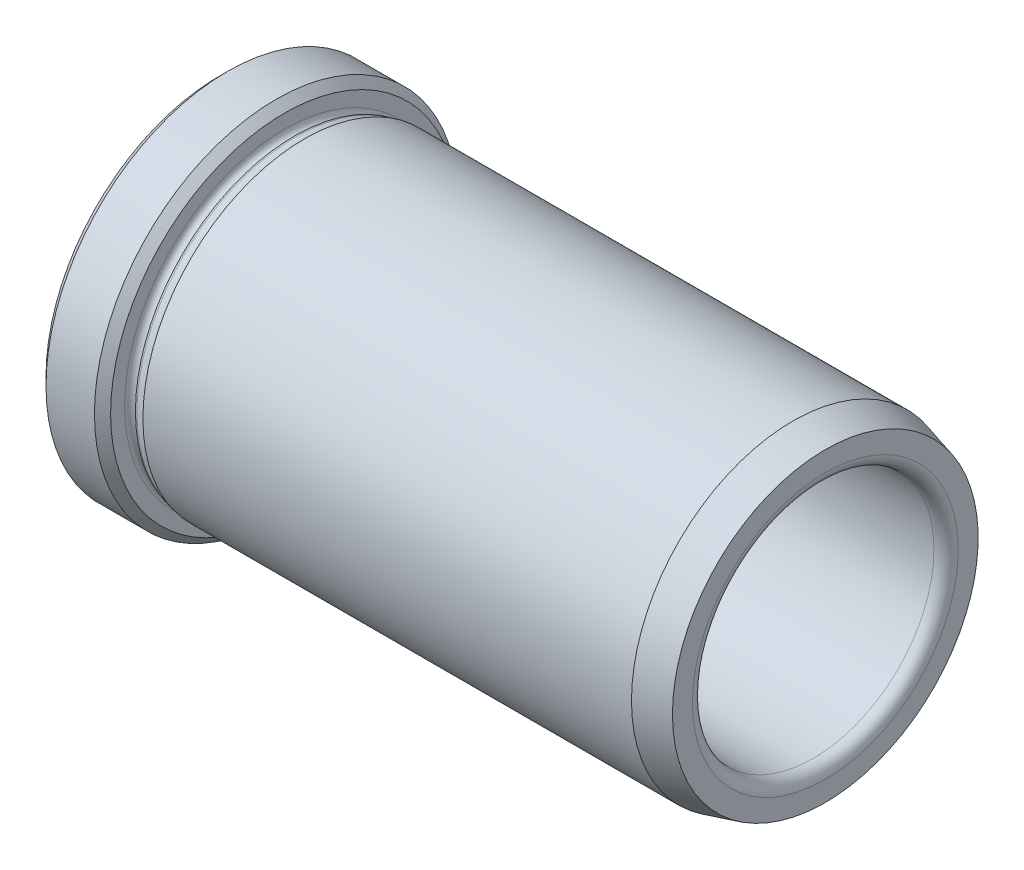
ISO-10303-21;
HEADER;
FILE_DESCRIPTION(('STEP AP214'),'2;1');
FILE_NAME('part.step','',(''),(''),'','','');
FILE_SCHEMA(('AUTOMOTIVE_DESIGN { 1 0 10303 214 1 1 1 1 }'));
ENDSEC;
DATA;
#1=APPLICATION_CONTEXT('core data for automotive mechanical design processes');
#2=APPLICATION_PROTOCOL_DEFINITION('international standard','automotive_design',2000,#1);
#3=PRODUCT_CONTEXT('',#1,'mechanical');
#4=PRODUCT('Part','Part','',(#3));
#5=PRODUCT_RELATED_PRODUCT_CATEGORY('part','',(#4));
#6=PRODUCT_DEFINITION_FORMATION('','',#4);
#7=PRODUCT_DEFINITION_CONTEXT('part definition',#1,'design');
#8=PRODUCT_DEFINITION('design','',#6,#7);
#9=PRODUCT_DEFINITION_SHAPE('','',#8);
#10=(LENGTH_UNIT() NAMED_UNIT(*) SI_UNIT(.MILLI.,.METRE.));
#11=(NAMED_UNIT(*) PLANE_ANGLE_UNIT() SI_UNIT($,.RADIAN.));
#12=(NAMED_UNIT(*) SI_UNIT($,.STERADIAN.) SOLID_ANGLE_UNIT());
#13=UNCERTAINTY_MEASURE_WITH_UNIT(LENGTH_MEASURE(1.E-05),#10,'distance_accuracy_value','');
#14=(GEOMETRIC_REPRESENTATION_CONTEXT(3) GLOBAL_UNCERTAINTY_ASSIGNED_CONTEXT((#13)) GLOBAL_UNIT_ASSIGNED_CONTEXT((#10,
#11,#12)) REPRESENTATION_CONTEXT('',''));
#15=CARTESIAN_POINT('',(0.,0.,0.));
#16=DIRECTION('',(0.,0.,1.));
#17=DIRECTION('',(1.,0.,0.));
#18=AXIS2_PLACEMENT_3D('',#15,#16,#17);
#19=CARTESIAN_POINT('',(30.9097582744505,14.95,0.));
#20=DIRECTION('',(1.,0.,0.));
#21=DIRECTION('',(0.,0.,-1.));
#22=AXIS2_PLACEMENT_3D('',#19,#20,#21);
#23=PLANE('',#22);
#24=CARTESIAN_POINT('',(30.9097582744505,0.,0.));
#25=DIRECTION('',(-1.,0.,0.));
#26=DIRECTION('',(0.,0.,1.));
#27=AXIS2_PLACEMENT_3D('',#24,#25,#26);
#28=CIRCLE('',#27,14.95);
#29=CARTESIAN_POINT('',(30.9097582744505,0.,14.95));
#30=VERTEX_POINT('',#29);
#31=EDGE_CURVE('E46',#30,#30,#28,.T.);
#32=ORIENTED_EDGE('',*,*,#31,.F.);
#33=EDGE_LOOP('',(#32));
#34=FACE_BOUND('',#33,.T.);
#35=CARTESIAN_POINT('',(30.9097582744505,0.,0.));
#36=DIRECTION('',(-1.,0.,0.));
#37=DIRECTION('',(0.,0.,1.));
#38=AXIS2_PLACEMENT_3D('',#35,#36,#37);
#39=CIRCLE('',#38,15.);
#40=CARTESIAN_POINT('',(30.9097582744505,0.,15.));
#41=VERTEX_POINT('',#40);
#42=EDGE_CURVE('E70',#41,#41,#39,.T.);
#43=ORIENTED_EDGE('',*,*,#42,.T.);
#44=EDGE_LOOP('',(#43));
#45=FACE_BOUND('',#44,.T.);
#46=ADVANCED_FACE('F14',(#34,#45),#23,.F.);
#47=CARTESIAN_POINT('',(0.,0.,0.));
#48=DIRECTION('',(-1.,0.,0.));
#49=DIRECTION('',(0.,0.,1.));
#50=AXIS2_PLACEMENT_3D('',#47,#48,#49);
#51=CYLINDRICAL_SURFACE('',#50,14.95);
#52=CARTESIAN_POINT('',(94.4097582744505,0.,0.));
#53=DIRECTION('',(-1.,0.,0.));
#54=DIRECTION('',(0.,0.,1.));
#55=AXIS2_PLACEMENT_3D('',#52,#53,#54);
#56=CIRCLE('',#55,14.95);
#57=CARTESIAN_POINT('',(94.4097582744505,0.,14.95));
#58=VERTEX_POINT('',#57);
#59=EDGE_CURVE('E34',#58,#58,#56,.F.);
#60=ORIENTED_EDGE('',*,*,#59,.T.);
#61=EDGE_LOOP('',(#60));
#62=FACE_BOUND('',#61,.T.);
#63=ORIENTED_EDGE('',*,*,#31,.T.);
#64=EDGE_LOOP('',(#63));
#65=FACE_BOUND('',#64,.T.);
#66=ADVANCED_FACE('F94',(#62,#65),#51,.F.);
#67=CARTESIAN_POINT('',(95.9097582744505,18.9282032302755,0.));
#68=DIRECTION('',(-1.,0.,0.));
#69=DIRECTION('',(0.,0.,1.));
#70=AXIS2_PLACEMENT_3D('',#67,#68,#69);
#71=PLANE('',#70);
#72=CARTESIAN_POINT('',(95.9097582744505,0.,0.));
#73=DIRECTION('',(-1.,0.,0.));
#74=DIRECTION('',(0.,0.,1.));
#75=AXIS2_PLACEMENT_3D('',#72,#73,#74);
#76=CIRCLE('',#75,16.45);
#77=CARTESIAN_POINT('',(95.9097582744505,0.,16.45));
#78=VERTEX_POINT('',#77);
#79=EDGE_CURVE('E37',#78,#78,#76,.T.);
#80=ORIENTED_EDGE('',*,*,#79,.T.);
#81=EDGE_LOOP('',(#80));
#82=FACE_BOUND('',#81,.T.);
#83=CARTESIAN_POINT('',(95.9097582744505,0.,0.));
#84=DIRECTION('',(-1.,0.,0.));
#85=DIRECTION('',(0.,0.,1.));
#86=AXIS2_PLACEMENT_3D('',#83,#84,#85);
#87=CIRCLE('',#86,18.9282032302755);
#88=CARTESIAN_POINT('',(95.9097582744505,0.,18.9282032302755));
#89=VERTEX_POINT('',#88);
#90=EDGE_CURVE('E49',#89,#89,#87,.T.);
#91=ORIENTED_EDGE('',*,*,#90,.F.);
#92=EDGE_LOOP('',(#91));
#93=FACE_BOUND('',#92,.T.);
#94=ADVANCED_FACE('F101',(#82,#93),#71,.F.);
#95=CARTESIAN_POINT('',(95.9097582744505,0.,0.));
#96=DIRECTION('',(-1.,0.,0.));
#97=DIRECTION('',(0.,0.,1.));
#98=AXIS2_PLACEMENT_3D('',#95,#96,#97);
#99=CONICAL_SURFACE('',#98,18.9282032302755,0.26179938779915);
#100=CARTESIAN_POINT('',(91.9097582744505,0.,0.));
#101=DIRECTION('',(-1.,0.,0.));
#102=DIRECTION('',(0.,0.,1.));
#103=AXIS2_PLACEMENT_3D('',#100,#101,#102);
#104=CIRCLE('',#103,20.);
#105=CARTESIAN_POINT('',(91.9097582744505,0.,20.));
#106=VERTEX_POINT('',#105);
#107=EDGE_CURVE('E52',#106,#106,#104,.T.);
#108=ORIENTED_EDGE('',*,*,#107,.F.);
#109=EDGE_LOOP('',(#108));
#110=FACE_BOUND('',#109,.T.);
#111=ORIENTED_EDGE('',*,*,#90,.T.);
#112=EDGE_LOOP('',(#111));
#113=FACE_BOUND('',#112,.T.);
#114=ADVANCED_FACE('F165',(#110,#113),#99,.T.);
#115=CARTESIAN_POINT('',(0.,0.,0.));
#116=DIRECTION('',(-1.,0.,0.));
#117=DIRECTION('',(0.,0.,1.));
#118=AXIS2_PLACEMENT_3D('',#115,#116,#117);
#119=CYLINDRICAL_SURFACE('',#118,20.);
#120=CARTESIAN_POINT('',(31.4097582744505,0.,0.));
#121=DIRECTION('',(-1.,0.,0.));
#122=DIRECTION('',(0.,0.,1.));
#123=AXIS2_PLACEMENT_3D('',#120,#121,#122);
#124=CIRCLE('',#123,20.);
#125=CARTESIAN_POINT('',(31.4097582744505,0.,20.));
#126=VERTEX_POINT('',#125);
#127=EDGE_CURVE('E55',#126,#126,#124,.T.);
#128=ORIENTED_EDGE('',*,*,#127,.F.);
#129=EDGE_LOOP('',(#128));
#130=FACE_BOUND('',#129,.T.);
#131=ORIENTED_EDGE('',*,*,#107,.T.);
#132=EDGE_LOOP('',(#131));
#133=FACE_BOUND('',#132,.T.);
#134=ADVANCED_FACE('F205',(#130,#133),#119,.T.);
#135=CARTESIAN_POINT('',(31.4097582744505,0.,0.));
#136=DIRECTION('',(1.,0.,0.));
#137=DIRECTION('',(0.,0.,-1.));
#138=AXIS2_PLACEMENT_3D('',#135,#136,#137);
#139=CONICAL_SURFACE('',#138,20.,0.26179938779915);
#140=CARTESIAN_POINT('',(30.391876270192,0.,0.));
#141=DIRECTION('',(-1.,0.,0.));
#142=DIRECTION('',(0.,0.,1.));
#143=AXIS2_PLACEMENT_3D('',#140,#141,#142);
#144=CIRCLE('',#143,19.7272593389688);
#145=CARTESIAN_POINT('',(30.391876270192,0.,19.7272593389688));
#146=VERTEX_POINT('',#145);
#147=EDGE_CURVE('E58',#146,#146,#144,.T.);
#148=ORIENTED_EDGE('',*,*,#147,.F.);
#149=EDGE_LOOP('',(#148));
#150=FACE_BOUND('',#149,.T.);
#151=ORIENTED_EDGE('',*,*,#127,.T.);
#152=EDGE_LOOP('',(#151));
#153=FACE_BOUND('',#152,.T.);
#154=ADVANCED_FACE('F195',(#150,#153),#139,.T.);
#155=CARTESIAN_POINT('',(30.18482103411,0.,0.));
#156=DIRECTION('',(-1.,0.,0.));
#157=DIRECTION('',(0.,0.,1.));
#158=AXIS2_PLACEMENT_3D('',#155,#156,#157);
#159=TOROIDAL_SURFACE('',#158,20.5,0.8);
#160=CARTESIAN_POINT('',(30.18482103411,0.,0.));
#161=DIRECTION('',(-1.,0.,0.));
#162=DIRECTION('',(0.,0.,1.));
#163=AXIS2_PLACEMENT_3D('',#160,#161,#162);
#164=CIRCLE('',#163,19.7);
#165=CARTESIAN_POINT('',(30.18482103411,0.,19.7));
#166=VERTEX_POINT('',#165);
#167=EDGE_CURVE('E61',#166,#166,#164,.T.);
#168=ORIENTED_EDGE('',*,*,#167,.F.);
#169=EDGE_LOOP('',(#168));
#170=FACE_BOUND('',#169,.T.);
#171=ORIENTED_EDGE('',*,*,#147,.T.);
#172=EDGE_LOOP('',(#171));
#173=FACE_BOUND('',#172,.T.);
#174=ADVANCED_FACE('F185',(#170,#173),#159,.F.);
#175=CARTESIAN_POINT('',(0.,0.,0.));
#176=DIRECTION('',(-1.,0.,0.));
#177=DIRECTION('',(0.,0.,1.));
#178=AXIS2_PLACEMENT_3D('',#175,#176,#177);
#179=CYLINDRICAL_SURFACE('',#178,19.7);
#180=CARTESIAN_POINT('',(30.5072104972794,0.,0.));
#181=DIRECTION('',(-1.,0.,0.));
#182=DIRECTION('',(0.,0.,1.));
#183=AXIS2_PLACEMENT_3D('',#180,#181,#182);
#184=CIRCLE('',#183,19.7);
#185=CARTESIAN_POINT('',(30.5072104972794,0.,19.7));
#186=VERTEX_POINT('',#185);
#187=EDGE_CURVE('E64',#186,#186,#184,.T.);
#188=ORIENTED_EDGE('',*,*,#187,.F.);
#189=EDGE_LOOP('',(#188));
#190=FACE_BOUND('',#189,.T.);
#191=ORIENTED_EDGE('',*,*,#167,.T.);
#192=EDGE_LOOP('',(#191));
#193=FACE_BOUND('',#192,.T.);
#194=ADVANCED_FACE('F175',(#190,#193),#179,.F.);
#195=CARTESIAN_POINT('',(29.7097582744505,0.,0.));
#196=DIRECTION('',(-1.,0.,0.));
#197=DIRECTION('',(0.,0.,1.));
#198=AXIS2_PLACEMENT_3D('',#195,#196,#197);
#199=TOROIDAL_SURFACE('',#198,19.7637961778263,0.8);
#200=CARTESIAN_POINT('',(28.9097582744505,0.,0.));
#201=DIRECTION('',(-1.,0.,0.));
#202=DIRECTION('',(0.,0.,1.));
#203=AXIS2_PLACEMENT_3D('',#200,#201,#202);
#204=CIRCLE('',#203,19.7637961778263);
#205=CARTESIAN_POINT('',(28.9097582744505,0.,19.7637961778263));
#206=VERTEX_POINT('',#205);
#207=EDGE_CURVE('E67',#206,#206,#204,.T.);
#208=ORIENTED_EDGE('',*,*,#207,.F.);
#209=EDGE_LOOP('',(#208));
#210=FACE_BOUND('',#209,.T.);
#211=ORIENTED_EDGE('',*,*,#187,.T.);
#212=EDGE_LOOP('',(#211));
#213=FACE_BOUND('',#212,.T.);
#214=ADVANCED_FACE('F154',(#210,#213),#199,.F.);
#215=CARTESIAN_POINT('',(28.9097582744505,22.5,0.));
#216=DIRECTION('',(-1.,0.,0.));
#217=DIRECTION('',(0.,0.,1.));
#218=AXIS2_PLACEMENT_3D('',#215,#216,#217);
#219=PLANE('',#218);
#220=CARTESIAN_POINT('',(28.9097582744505,0.,0.));
#221=DIRECTION('',(-1.,0.,0.));
#222=DIRECTION('',(0.,0.,1.));
#223=AXIS2_PLACEMENT_3D('',#220,#221,#222);
#224=CIRCLE('',#223,21.5);
#225=CARTESIAN_POINT('',(28.9097582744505,0.,21.5));
#226=VERTEX_POINT('',#225);
#227=EDGE_CURVE('E9',#226,#226,#224,.F.);
#228=ORIENTED_EDGE('',*,*,#227,.T.);
#229=EDGE_LOOP('',(#228));
#230=FACE_BOUND('',#229,.T.);
#231=ORIENTED_EDGE('',*,*,#207,.T.);
#232=EDGE_LOOP('',(#231));
#233=FACE_BOUND('',#232,.T.);
#234=ADVANCED_FACE('F144',(#230,#233),#219,.F.);
#235=CARTESIAN_POINT('',(0.,0.,0.));
#236=DIRECTION('',(-1.,0.,0.));
#237=DIRECTION('',(0.,0.,1.));
#238=AXIS2_PLACEMENT_3D('',#235,#236,#237);
#239=CYLINDRICAL_SURFACE('',#238,22.5);
#240=CARTESIAN_POINT('',(27.9097582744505,0.,0.));
#241=DIRECTION('',(-1.,0.,0.));
#242=DIRECTION('',(0.,0.,1.));
#243=AXIS2_PLACEMENT_3D('',#240,#241,#242);
#244=CIRCLE('',#243,22.5);
#245=CARTESIAN_POINT('',(27.9097582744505,0.,22.5));
#246=VERTEX_POINT('',#245);
#247=EDGE_CURVE('E21',#246,#246,#244,.T.);
#248=ORIENTED_EDGE('',*,*,#247,.T.);
#249=EDGE_LOOP('',(#248));
#250=FACE_BOUND('',#249,.T.);
#251=CARTESIAN_POINT('',(21.9097582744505,0.,0.));
#252=DIRECTION('',(1.,0.,0.));
#253=DIRECTION('',(0.,0.,-1.));
#254=AXIS2_PLACEMENT_3D('',#251,#252,#253);
#255=CIRCLE('',#254,22.5);
#256=CARTESIAN_POINT('',(21.9097582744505,0.,-22.5));
#257=VERTEX_POINT('',#256);
#258=EDGE_CURVE('E40',#257,#257,#255,.T.);
#259=ORIENTED_EDGE('',*,*,#258,.T.);
#260=EDGE_LOOP('',(#259));
#261=FACE_BOUND('',#260,.T.);
#262=ADVANCED_FACE('F90',(#250,#261),#239,.T.);
#263=CARTESIAN_POINT('',(20.9097582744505,22.5,0.));
#264=DIRECTION('',(1.,0.,0.));
#265=DIRECTION('',(0.,0.,-1.));
#266=AXIS2_PLACEMENT_3D('',#263,#264,#265);
#267=PLANE('',#266);
#268=CARTESIAN_POINT('',(20.9097582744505,0.,0.));
#269=DIRECTION('',(1.,0.,0.));
#270=DIRECTION('',(0.,0.,-1.));
#271=AXIS2_PLACEMENT_3D('',#268,#269,#270);
#272=CIRCLE('',#271,16.5);
#273=CARTESIAN_POINT('',(20.9097582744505,0.,-16.5));
#274=VERTEX_POINT('',#273);
#275=EDGE_CURVE('E25',#274,#274,#272,.T.);
#276=ORIENTED_EDGE('',*,*,#275,.T.);
#277=EDGE_LOOP('',(#276));
#278=FACE_BOUND('',#277,.T.);
#279=CARTESIAN_POINT('',(20.9097582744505,0.,0.));
#280=DIRECTION('',(1.,0.,0.));
#281=DIRECTION('',(0.,0.,-1.));
#282=AXIS2_PLACEMENT_3D('',#279,#280,#281);
#283=CIRCLE('',#282,21.5);
#284=CARTESIAN_POINT('',(20.9097582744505,0.,-21.5));
#285=VERTEX_POINT('',#284);
#286=EDGE_CURVE('E43',#285,#285,#283,.F.);
#287=ORIENTED_EDGE('',*,*,#286,.T.);
#288=EDGE_LOOP('',(#287));
#289=FACE_BOUND('',#288,.T.);
#290=ADVANCED_FACE('F78',(#278,#289),#267,.F.);
#291=CARTESIAN_POINT('',(0.,0.,0.));
#292=DIRECTION('',(-1.,0.,0.));
#293=DIRECTION('',(0.,0.,1.));
#294=AXIS2_PLACEMENT_3D('',#291,#292,#293);
#295=CYLINDRICAL_SURFACE('',#294,15.);
#296=CARTESIAN_POINT('',(22.4097582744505,0.,0.));
#297=DIRECTION('',(1.,0.,0.));
#298=DIRECTION('',(0.,0.,-1.));
#299=AXIS2_PLACEMENT_3D('',#296,#297,#298);
#300=CIRCLE('',#299,15.);
#301=CARTESIAN_POINT('',(22.4097582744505,0.,-15.));
#302=VERTEX_POINT('',#301);
#303=EDGE_CURVE('E29',#302,#302,#300,.F.);
#304=ORIENTED_EDGE('',*,*,#303,.T.);
#305=EDGE_LOOP('',(#304));
#306=FACE_BOUND('',#305,.T.);
#307=ORIENTED_EDGE('',*,*,#42,.F.);
#308=EDGE_LOOP('',(#307));
#309=FACE_BOUND('',#308,.T.);
#310=ADVANCED_FACE('F75',(#306,#309),#295,.F.);
#311=CARTESIAN_POINT('',(20.9097582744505,0.,0.));
#312=DIRECTION('',(1.,0.,0.));
#313=DIRECTION('',(0.,0.,-1.));
#314=AXIS2_PLACEMENT_3D('',#311,#312,#313);
#315=CONICAL_SURFACE('',#314,21.5,0.785398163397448);
#316=ORIENTED_EDGE('',*,*,#258,.F.);
#317=EDGE_LOOP('',(#316));
#318=FACE_BOUND('',#317,.T.);
#319=ORIENTED_EDGE('',*,*,#286,.F.);
#320=EDGE_LOOP('',(#319));
#321=FACE_BOUND('',#320,.T.);
#322=ADVANCED_FACE('F77',(#318,#321),#315,.T.);
#323=CARTESIAN_POINT('',(94.4097582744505,0.,0.));
#324=DIRECTION('',(-1.,0.,0.));
#325=DIRECTION('',(0.,0.,1.));
#326=AXIS2_PLACEMENT_3D('',#323,#324,#325);
#327=TOROIDAL_SURFACE('',#326,16.45,1.5);
#328=ORIENTED_EDGE('',*,*,#59,.F.);
#329=EDGE_LOOP('',(#328));
#330=FACE_BOUND('',#329,.T.);
#331=ORIENTED_EDGE('',*,*,#79,.F.);
#332=EDGE_LOOP('',(#331));
#333=FACE_BOUND('',#332,.T.);
#334=ADVANCED_FACE('F87',(#330,#333),#327,.T.);
#335=CARTESIAN_POINT('',(22.4097582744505,0.,0.));
#336=DIRECTION('',(1.,0.,0.));
#337=DIRECTION('',(0.,0.,-1.));
#338=AXIS2_PLACEMENT_3D('',#335,#336,#337);
#339=TOROIDAL_SURFACE('',#338,16.5,1.5);
#340=ORIENTED_EDGE('',*,*,#275,.F.);
#341=EDGE_LOOP('',(#340));
#342=FACE_BOUND('',#341,.T.);
#343=ORIENTED_EDGE('',*,*,#303,.F.);
#344=EDGE_LOOP('',(#343));
#345=FACE_BOUND('',#344,.T.);
#346=ADVANCED_FACE('F108',(#342,#345),#339,.T.);
#347=CARTESIAN_POINT('',(27.9097582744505,0.,0.));
#348=DIRECTION('',(-1.,0.,0.));
#349=DIRECTION('',(0.,0.,1.));
#350=AXIS2_PLACEMENT_3D('',#347,#348,#349);
#351=CONICAL_SURFACE('',#350,22.5,0.78539816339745);
#352=ORIENTED_EDGE('',*,*,#227,.F.);
#353=EDGE_LOOP('',(#352));
#354=FACE_BOUND('',#353,.T.);
#355=ORIENTED_EDGE('',*,*,#247,.F.);
#356=EDGE_LOOP('',(#355));
#357=FACE_BOUND('',#356,.T.);
#358=ADVANCED_FACE('F16',(#354,#357),#351,.T.);
#359=CLOSED_SHELL('',(#46,#66,#94,#114,#134,#154,#174,#194,#214,#234,#262,#290,#310,#322,#334,
#346,#358));
#360=MANIFOLD_SOLID_BREP('B1',#359);
#361=ADVANCED_BREP_SHAPE_REPRESENTATION('',(#18,#360),#14);
#362=SHAPE_DEFINITION_REPRESENTATION(#9,#361);
ENDSEC;
END-ISO-10303-21;
